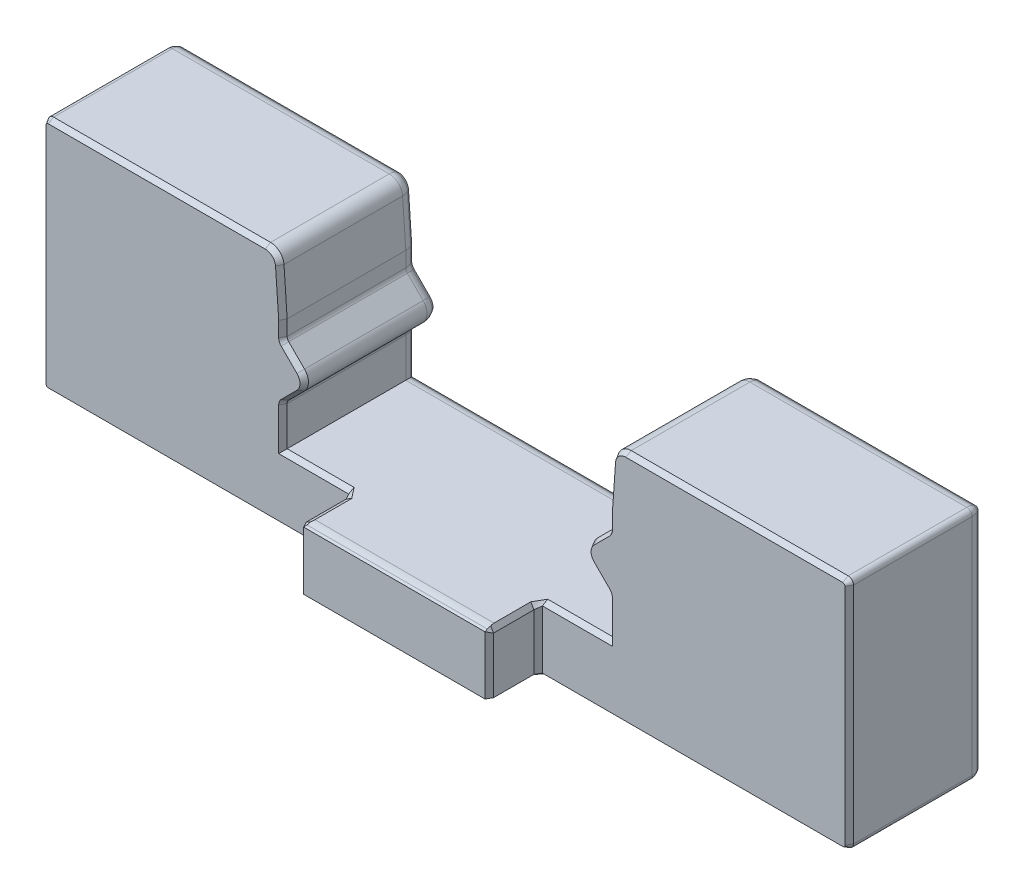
from build123d import *
from OCP.BRepFilletAPI import BRepFilletAPI_MakeChamfer

# Parameters (mm, degrees)
BOSS_EXTRUDE1_DEPTH = 6.858
SKETCH4_W           = 34.070954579
SKETCH4_H           = 13.765156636
SKETCH4_W_2         = 6.985
SKETCH4_H_2         = 3.770074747
CUT_EXTRUDE3_DEPTH  = 1.905
FILLET1_R           = 0.2
CHAMFER1_SIZE       = 2.159
CHAMFER1_SIZE2      = 0.150971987
FILLET2_R           = 0.5
FILLET3_R           = 0.5
CHAMFER2_SIZE       = 0.2
CHAMFER2_SIZE2      = 0.115470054
FILLET4_R           = 0.5


with BuildPart() as part:
    # Sketch1 → Boss-Extrude1 (new body)
    with BuildSketch(Plane.XY):
        Polygon((0, 0), (30, 0), (30, 8.75), (21.1, 8.75), (21.1, 5.94), (20.1, 4.94), (21.1, 3.94), (21.1, 2.4), (8.9, 2.4), (8.9, 3.94), (9.9, 4.94), (8.9, 5.94), (8.9, 8.75), (0, 8.75), align=None)
    extrude(amount=BOSS_EXTRUDE1_DEPTH)

    # Sketch4 → Cut-Extrude3 (cut)
    with BuildSketch(Plane.XY.offset(6.858)):
        with Locations((15.184119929, 3.86647829)):
            Rectangle(SKETCH4_W, SKETCH4_H)
        with Locations((15, 1.113446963)):
            Rectangle(SKETCH4_W_2, SKETCH4_H_2, mode=Mode.SUBTRACT)
    extrude(amount=-CUT_EXTRUDE3_DEPTH, mode=Mode.SUBTRACT)

    # Fillet1
    fillet1_edges = [part.edges().sort_by_distance(p)[0] for p in [
        (0, 8.75, 2.4765),
        (8.9, 5.94, 2.4765),
        (8.9, 3.94, 2.4765),
        (21.1, 3.94, 2.4765),
        (21.1, 5.94, 2.4765),
        (30, 8.75, 2.4765),
        (30, 0, 2.4765),
        (0, 0, 2.4765),
    ]]
    fillet(fillet1_edges, radius=FILLET1_R)

    # Chamfer1: one chamfer whose edges measure the first distance from different faces: ONE call of the kernel's chamfer builder (chamfer() names one face for all edges)
    chamfer1_edges_1 = [part.edges().sort_by_distance(p)[0] for p in [
        (8.9, 8.75, 2.4765),
    ]]
    chamfer1_side_1 = [part.faces().sort_by_distance(p)[0] for p in [
        (8.9, 7.386421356, 2.4765),
    ]]
    chamfer1_edges_2 = [part.edges().sort_by_distance(p)[0] for p in [
        (21.1, 8.75, 2.4765),
    ]]
    chamfer1_side_2 = [part.faces().sort_by_distance(p)[0] for p in [
        (21.1, 7.386421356, 2.4765),
    ]]
    chamfer1 = BRepFilletAPI_MakeChamfer(part.part.solid().wrapped)
    for e in chamfer1_edges_1:
        chamfer1.Add(CHAMFER1_SIZE, CHAMFER1_SIZE2, e.wrapped, chamfer1_side_1[0].wrapped)  # the first distance lies on this face
    for e in chamfer1_edges_2:
        chamfer1.Add(CHAMFER1_SIZE, CHAMFER1_SIZE2, e.wrapped, chamfer1_side_2[0].wrapped)  # the first distance lies on this face
    add(Compound.cast(chamfer1.Shape()), mode=Mode.REPLACE)

    # Fillet2
    fillet2_edges = [part.edges().sort_by_distance(p)[0] for p in [
        (9.9, 4.94, 2.4765),
        (20.1, 4.94, 2.4765),
    ]]
    fillet(fillet2_edges, radius=FILLET2_R)

    # Fillet3
    fillet3_edges = [part.edges().sort_by_distance(p)[0] for p in [
        (21.250971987, 8.75, 2.4765),
        (8.749028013, 8.75, 2.4765),
    ]]
    fillet(fillet3_edges, radius=FILLET3_R)

    # Chamfer2: one chamfer whose edges measure the first distance from different faces: ONE call of the kernel's chamfer builder (chamfer() names one face for all edges)
    chamfer2_edges_1 = [part.edges().sort_by_distance(p)[0] for p in [
        (20.747487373, 5.587487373, 4.953),
        (20.747487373, 5.587487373, 0),
    ]]
    chamfer2_side_1 = [part.faces().sort_by_distance(p)[0] for p in [
        (20.747487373, 5.587487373, 2.4765),
    ]]
    chamfer2_edges_2 = [part.edges().sort_by_distance(p)[0] for p in [
        (21.1, 3.128578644, 4.953),
        (21.1, 3.128578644, 0),
    ]]
    chamfer2_side_2 = [part.faces().sort_by_distance(p)[0] for p in [
        (21.1, 3.128578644, 2.4765),
    ]]
    chamfer2_edges_3 = [part.edges().sort_by_distance(p)[0] for p in [
        (9.252512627, 4.292512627, 4.953),
        (9.252512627, 4.292512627, 0),
    ]]
    chamfer2_side_3 = [part.faces().sort_by_distance(p)[0] for p in [
        (9.252512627, 4.292512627, 2.4765),
    ]]
    chamfer2_edges_4 = [part.edges().sort_by_distance(p)[0] for p in [
        (8.9, 6.306921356, 4.953),
        (8.9, 6.306921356, 0),
    ]]
    chamfer2_side_4 = [part.faces().sort_by_distance(p)[0] for p in [
        (8.9, 6.306921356, 2.4765),
    ]]
    chamfer2_edges_5 = [part.edges().sort_by_distance(p)[0] for p in [
        (30, 4.375, 4.953),
        (30, 4.375, 0),
    ]]
    chamfer2_side_5 = [part.faces().sort_by_distance(p)[0] for p in [
        (30, 4.375, 2.4765),
    ]]
    chamfer2_edges_6 = [part.edges().sort_by_distance(p)[0] for p in [
        (0, 4.375, 0),
        (0, 4.375, 4.953),
    ]]
    chamfer2_side_6 = [part.faces().sort_by_distance(p)[0] for p in [
        (0, 4.375, 2.4765),
    ]]
    chamfer2_edges_7 = [part.edges().sort_by_distance(p)[0] for p in [
        (25.758614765, 8.75, 0),
        (25.758614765, 8.75, 4.953),
    ]]
    chamfer2_side_7 = [part.faces().sort_by_distance(p)[0] for p in [
        (25.758614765, 8.75, 2.4765),
    ]]
    chamfer2_edges_8 = [part.edges().sort_by_distance(p)[0] for p in [
        (15, 0, 0),
        (5.85375, 0, 4.953),
        (15, 0, 6.858),
        (18.4925, 0, 5.9055),
        (24.14625, 0, 4.953),
    ]]
    chamfer2_side_8 = [part.faces().sort_by_distance(p)[0] for p in [
        (15, 0, 2.761824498),
    ]]
    chamfer2_edges_9 = [part.edges().sort_by_distance(p)[0] for p in [
        (0.058578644, 8.691421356, 0),
        (0.058578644, 8.691421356, 4.953),
    ]]
    chamfer2_side_9 = [part.faces().sort_by_distance(p)[0] for p in [
        (0.058578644, 8.691421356, 2.4765),
    ]]
    chamfer2_edges_10 = [part.edges().sort_by_distance(p)[0] for p in [
        (29.941421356, 8.691421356, 0),
        (29.941421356, 8.691421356, 4.953),
    ]]
    chamfer2_side_10 = [part.faces().sort_by_distance(p)[0] for p in [
        (29.941421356, 8.691421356, 2.4765),
    ]]
    chamfer2_edges_11 = [part.edges().sort_by_distance(p)[0] for p in [
        (0.058578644, 0.058578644, 0),
        (0.058578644, 0.058578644, 4.953),
    ]]
    chamfer2_side_11 = [part.faces().sort_by_distance(p)[0] for p in [
        (0.058578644, 0.058578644, 2.4765),
    ]]
    chamfer2_edges_12 = [part.edges().sort_by_distance(p)[0] for p in [
        (29.941421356, 0.058578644, 0),
        (29.941421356, 0.058578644, 4.953),
    ]]
    chamfer2_side_12 = [part.faces().sort_by_distance(p)[0] for p in [
        (29.941421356, 0.058578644, 2.4765),
    ]]
    chamfer2_edges_13 = [part.edges().sort_by_distance(p)[0] for p in [
        (21.084775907, 5.946306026, 0),
        (21.084775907, 5.946306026, 4.953),
    ]]
    chamfer2_side_13 = [part.faces().sort_by_distance(p)[0] for p in [
        (21.084775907, 5.946306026, 2.4765),
    ]]
    chamfer2_edges_14 = [part.edges().sort_by_distance(p)[0] for p in [
        (21.084775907, 3.933693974, 0),
        (21.084775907, 3.933693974, 4.953),
    ]]
    chamfer2_side_14 = [part.faces().sort_by_distance(p)[0] for p in [
        (21.084775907, 3.933693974, 2.4765),
    ]]
    chamfer2_edges_15 = [part.edges().sort_by_distance(p)[0] for p in [
        (8.915224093, 3.933693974, 0),
        (8.915224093, 3.933693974, 4.953),
    ]]
    chamfer2_side_15 = [part.faces().sort_by_distance(p)[0] for p in [
        (8.915224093, 3.933693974, 2.4765),
    ]]
    chamfer2_edges_16 = [part.edges().sort_by_distance(p)[0] for p in [
        (8.915224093, 5.946306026, 0),
        (8.915224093, 5.946306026, 4.953),
    ]]
    chamfer2_side_16 = [part.faces().sort_by_distance(p)[0] for p in [
        (8.915224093, 5.946306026, 2.4765),
    ]]
    chamfer2_edges_17 = [part.edges().sort_by_distance(p)[0] for p in [
        (8.9, 3.128578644, 0),
        (8.9, 3.128578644, 4.953),
    ]]
    chamfer2_side_17 = [part.faces().sort_by_distance(p)[0] for p in [
        (8.9, 3.128578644, 2.4765),
    ]]
    chamfer2_edges_18 = [part.edges().sort_by_distance(p)[0] for p in [
        (21.1, 6.306921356, 0),
        (21.1, 6.306921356, 4.953),
    ]]
    chamfer2_side_18 = [part.faces().sort_by_distance(p)[0] for p in [
        (21.1, 6.306921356, 2.4765),
    ]]
    chamfer2_edges_19 = [part.edges().sort_by_distance(p)[0] for p in [
        (21.159223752, 7.437939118, 0),
        (21.159223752, 7.437939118, 4.953),
    ]]
    chamfer2_side_19 = [part.faces().sort_by_distance(p)[0] for p in [
        (21.159223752, 7.437939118, 2.4765),
    ]]
    chamfer2_edges_20 = [part.edges().sort_by_distance(p)[0] for p in [
        (15, 2.4, 0),
        (15, 2.4, 6.858),
        (19.79625, 2.4, 4.953),
        (10.20375, 2.4, 4.953),
        (11.5075, 2.4, 5.9055),
    ]]
    chamfer2_side_20 = [part.faces().sort_by_distance(p)[0] for p in [
        (15, 2.4, 3.095323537),
    ]]
    chamfer2_edges_21 = [part.edges().sort_by_distance(p)[0] for p in [
        (8.840776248, 7.437939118, 4.953),
        (8.840776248, 7.437939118, 0),
    ]]
    chamfer2_side_21 = [part.faces().sort_by_distance(p)[0] for p in [
        (8.840776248, 7.437939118, 2.4765),
    ]]
    chamfer2_edges_22 = [part.edges().sort_by_distance(p)[0] for p in [
        (20.747487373, 4.292512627, 0),
        (20.747487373, 4.292512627, 4.953),
    ]]
    chamfer2_side_22 = [part.faces().sort_by_distance(p)[0] for p in [
        (20.747487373, 4.292512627, 2.4765),
    ]]
    chamfer2_edges_23 = [part.edges().sort_by_distance(p)[0] for p in [
        (9.252512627, 5.587487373, 0),
        (9.252512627, 5.587487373, 4.953),
    ]]
    chamfer2_side_23 = [part.faces().sort_by_distance(p)[0] for p in [
        (9.252512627, 5.587487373, 2.4765),
    ]]
    chamfer2_edges_24 = [part.edges().sort_by_distance(p)[0] for p in [
        (9.692893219, 4.94, 0),
        (9.692893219, 4.94, 4.953),
    ]]
    chamfer2_side_24 = [part.faces().sort_by_distance(p)[0] for p in [
        (9.692893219, 4.94, 2.4765),
    ]]
    chamfer2_edges_25 = [part.edges().sort_by_distance(p)[0] for p in [
        (20.307106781, 4.94, 0),
        (20.307106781, 4.94, 4.953),
    ]]
    chamfer2_side_25 = [part.faces().sort_by_distance(p)[0] for p in [
        (20.307106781, 4.94, 2.4765),
    ]]
    chamfer2_edges_26 = [part.edges().sort_by_distance(p)[0] for p in [
        (21.37623035, 8.615676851, 4.953),
        (21.37623035, 8.615676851, 0),
    ]]
    chamfer2_side_26 = [part.faces().sort_by_distance(p)[0] for p in [
        (21.37623035, 8.615676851, 2.4765),
    ]]
    chamfer2_edges_27 = [part.edges().sort_by_distance(p)[0] for p in [
        (4.241385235, 8.75, 0),
        (4.241385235, 8.75, 4.953),
    ]]
    chamfer2_side_27 = [part.faces().sort_by_distance(p)[0] for p in [
        (4.241385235, 8.75, 2.4765),
    ]]
    chamfer2_edges_28 = [part.edges().sort_by_distance(p)[0] for p in [
        (8.62376965, 8.615676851, 0),
        (8.62376965, 8.615676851, 4.953),
    ]]
    chamfer2_side_28 = [part.faces().sort_by_distance(p)[0] for p in [
        (8.62376965, 8.615676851, 2.4765),
    ]]
    chamfer2_edges_29 = [part.edges().sort_by_distance(p)[0] for p in [
        (18.4925, 1.2, 6.858),
        (18.4925, 1.2, 4.953),
        (18.4925, 2.4, 5.9055),
    ]]
    chamfer2_side_29 = [part.faces().sort_by_distance(p)[0] for p in [
        (18.4925, 1.2, 5.9055),
    ]]
    chamfer2_edges_30 = [part.edges().sort_by_distance(p)[0] for p in [
        (11.5075, 1.2, 6.858),
        (11.5075, 1.2, 4.953),
        (11.5075, 0, 5.9055),
    ]]
    chamfer2_side_30 = [part.faces().sort_by_distance(p)[0] for p in [
        (11.5075, 1.2, 5.9055),
    ]]
    chamfer2 = BRepFilletAPI_MakeChamfer(part.part.solid().wrapped)
    for e in chamfer2_edges_1:
        chamfer2.Add(CHAMFER2_SIZE, CHAMFER2_SIZE2, e.wrapped, chamfer2_side_1[0].wrapped)  # the first distance lies on this face
    for e in chamfer2_edges_2:
        chamfer2.Add(CHAMFER2_SIZE, CHAMFER2_SIZE2, e.wrapped, chamfer2_side_2[0].wrapped)  # the first distance lies on this face
    for e in chamfer2_edges_3:
        chamfer2.Add(CHAMFER2_SIZE, CHAMFER2_SIZE2, e.wrapped, chamfer2_side_3[0].wrapped)  # the first distance lies on this face
    for e in chamfer2_edges_4:
        chamfer2.Add(CHAMFER2_SIZE, CHAMFER2_SIZE2, e.wrapped, chamfer2_side_4[0].wrapped)  # the first distance lies on this face
    for e in chamfer2_edges_5:
        chamfer2.Add(CHAMFER2_SIZE, CHAMFER2_SIZE2, e.wrapped, chamfer2_side_5[0].wrapped)  # the first distance lies on this face
    for e in chamfer2_edges_6:
        chamfer2.Add(CHAMFER2_SIZE, CHAMFER2_SIZE2, e.wrapped, chamfer2_side_6[0].wrapped)  # the first distance lies on this face
    for e in chamfer2_edges_7:
        chamfer2.Add(CHAMFER2_SIZE, CHAMFER2_SIZE2, e.wrapped, chamfer2_side_7[0].wrapped)  # the first distance lies on this face
    for e in chamfer2_edges_8:
        chamfer2.Add(CHAMFER2_SIZE, CHAMFER2_SIZE2, e.wrapped, chamfer2_side_8[0].wrapped)  # the first distance lies on this face
    for e in chamfer2_edges_9:
        chamfer2.Add(CHAMFER2_SIZE, CHAMFER2_SIZE2, e.wrapped, chamfer2_side_9[0].wrapped)  # the first distance lies on this face
    for e in chamfer2_edges_10:
        chamfer2.Add(CHAMFER2_SIZE, CHAMFER2_SIZE2, e.wrapped, chamfer2_side_10[0].wrapped)  # the first distance lies on this face
    for e in chamfer2_edges_11:
        chamfer2.Add(CHAMFER2_SIZE, CHAMFER2_SIZE2, e.wrapped, chamfer2_side_11[0].wrapped)  # the first distance lies on this face
    for e in chamfer2_edges_12:
        chamfer2.Add(CHAMFER2_SIZE, CHAMFER2_SIZE2, e.wrapped, chamfer2_side_12[0].wrapped)  # the first distance lies on this face
    for e in chamfer2_edges_13:
        chamfer2.Add(CHAMFER2_SIZE, CHAMFER2_SIZE2, e.wrapped, chamfer2_side_13[0].wrapped)  # the first distance lies on this face
    for e in chamfer2_edges_14:
        chamfer2.Add(CHAMFER2_SIZE, CHAMFER2_SIZE2, e.wrapped, chamfer2_side_14[0].wrapped)  # the first distance lies on this face
    for e in chamfer2_edges_15:
        chamfer2.Add(CHAMFER2_SIZE, CHAMFER2_SIZE2, e.wrapped, chamfer2_side_15[0].wrapped)  # the first distance lies on this face
    for e in chamfer2_edges_16:
        chamfer2.Add(CHAMFER2_SIZE, CHAMFER2_SIZE2, e.wrapped, chamfer2_side_16[0].wrapped)  # the first distance lies on this face
    for e in chamfer2_edges_17:
        chamfer2.Add(CHAMFER2_SIZE, CHAMFER2_SIZE2, e.wrapped, chamfer2_side_17[0].wrapped)  # the first distance lies on this face
    for e in chamfer2_edges_18:
        chamfer2.Add(CHAMFER2_SIZE, CHAMFER2_SIZE2, e.wrapped, chamfer2_side_18[0].wrapped)  # the first distance lies on this face
    for e in chamfer2_edges_19:
        chamfer2.Add(CHAMFER2_SIZE, CHAMFER2_SIZE2, e.wrapped, chamfer2_side_19[0].wrapped)  # the first distance lies on this face
    for e in chamfer2_edges_20:
        chamfer2.Add(CHAMFER2_SIZE, CHAMFER2_SIZE2, e.wrapped, chamfer2_side_20[0].wrapped)  # the first distance lies on this face
    for e in chamfer2_edges_21:
        chamfer2.Add(CHAMFER2_SIZE, CHAMFER2_SIZE2, e.wrapped, chamfer2_side_21[0].wrapped)  # the first distance lies on this face
    for e in chamfer2_edges_22:
        chamfer2.Add(CHAMFER2_SIZE, CHAMFER2_SIZE2, e.wrapped, chamfer2_side_22[0].wrapped)  # the first distance lies on this face
    for e in chamfer2_edges_23:
        chamfer2.Add(CHAMFER2_SIZE, CHAMFER2_SIZE2, e.wrapped, chamfer2_side_23[0].wrapped)  # the first distance lies on this face
    for e in chamfer2_edges_24:
        chamfer2.Add(CHAMFER2_SIZE, CHAMFER2_SIZE2, e.wrapped, chamfer2_side_24[0].wrapped)  # the first distance lies on this face
    for e in chamfer2_edges_25:
        chamfer2.Add(CHAMFER2_SIZE, CHAMFER2_SIZE2, e.wrapped, chamfer2_side_25[0].wrapped)  # the first distance lies on this face
    for e in chamfer2_edges_26:
        chamfer2.Add(CHAMFER2_SIZE, CHAMFER2_SIZE2, e.wrapped, chamfer2_side_26[0].wrapped)  # the first distance lies on this face
    for e in chamfer2_edges_27:
        chamfer2.Add(CHAMFER2_SIZE, CHAMFER2_SIZE2, e.wrapped, chamfer2_side_27[0].wrapped)  # the first distance lies on this face
    for e in chamfer2_edges_28:
        chamfer2.Add(CHAMFER2_SIZE, CHAMFER2_SIZE2, e.wrapped, chamfer2_side_28[0].wrapped)  # the first distance lies on this face
    for e in chamfer2_edges_29:
        chamfer2.Add(CHAMFER2_SIZE, CHAMFER2_SIZE2, e.wrapped, chamfer2_side_29[0].wrapped)  # the first distance lies on this face
    for e in chamfer2_edges_30:
        chamfer2.Add(CHAMFER2_SIZE, CHAMFER2_SIZE2, e.wrapped, chamfer2_side_30[0].wrapped)  # the first distance lies on this face
    add(Compound.cast(chamfer2.Shape()), mode=Mode.REPLACE)

    # Fillet4
    fillet4_edges = [part.edges().sort_by_distance(p)[0] for p in [
        (15, 0, 0.2),
        (15.042264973, 2.4, 6.658),
        (15, 2.4, 0.2),
        (29.941421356, 8.691421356, 0.2),
        (30, 4.375, 0.2),
        (29.941421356, 0.058578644, 0.2),
        (21.1, 3.128578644, 0.2),
        (21.084775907, 3.933693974, 0.2),
        (20.747487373, 4.292512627, 0.2),
        (20.307106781, 4.94, 0.2),
        (20.747487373, 5.587487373, 0.2),
        (21.084775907, 5.946306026, 0.2),
        (21.1, 6.306921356, 0.2),
        (21.159223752, 7.437939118, 0.2),
        (21.37623035, 8.615676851, 0.2),
        (25.758614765, 8.75, 0.2),
        (8.9, 6.306921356, 0.2),
        (8.915224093, 5.946306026, 0.2),
        (9.252512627, 5.587487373, 0.2),
        (9.692893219, 4.94, 0.2),
        (9.252512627, 4.292512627, 0.2),
        (8.915224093, 3.933693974, 0.2),
        (8.9, 3.128578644, 0.2),
        (0.058578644, 0.058578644, 0.2),
        (0, 4.375, 0.2),
        (0.058578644, 8.691421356, 0.2),
        (4.241385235, 8.75, 0.2),
        (8.62376965, 8.615676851, 0.2),
        (8.840776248, 7.437939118, 0.2),
    ]]
    fillet(fillet4_edges, radius=FILLET4_R)


solid = part.part
